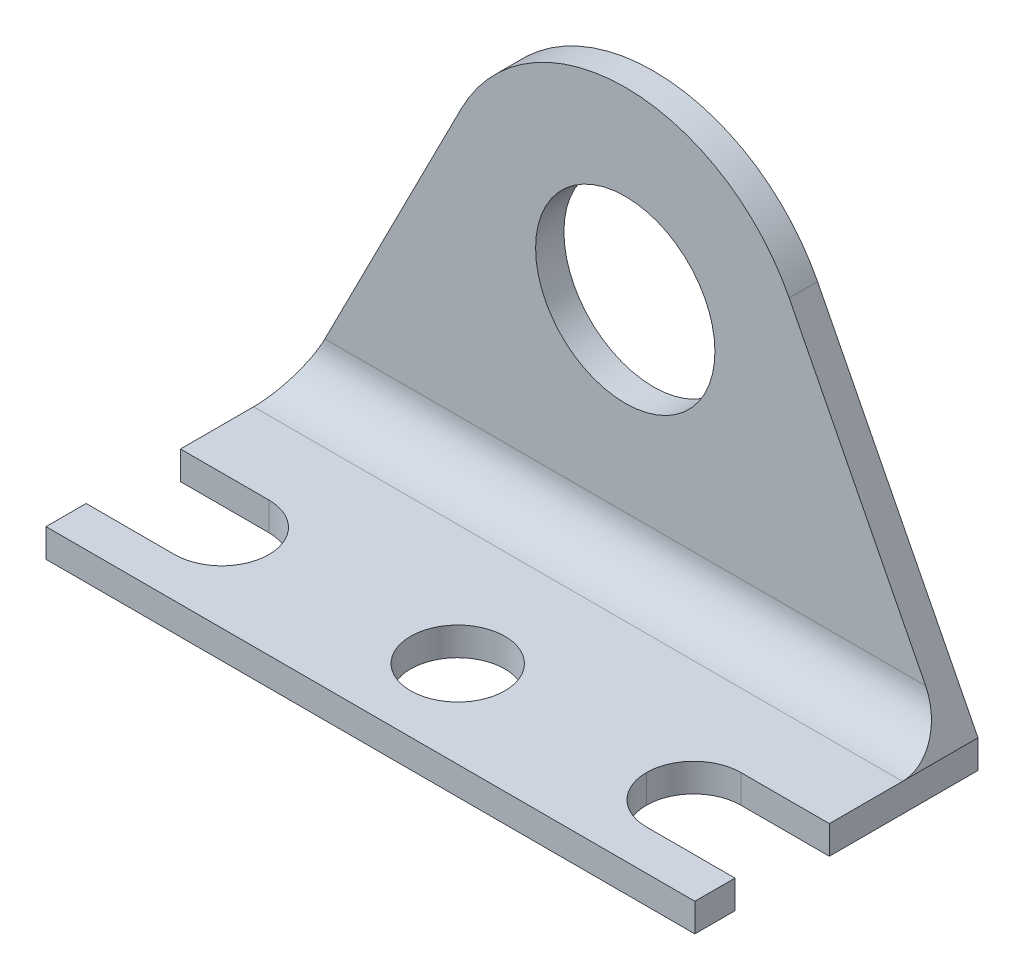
from build123d import *

# Parameters (mm, degrees)
SKETCH1_R               = 4.826
EXTRUDE1_DEPTH          = 1.524
SKETCH2_W               = 34.925
SKETCH2_H               = 1.524
EXTRUDE2_DEPTH          = 15.24
SKETCH3_R               = 2.54
CUT_EXTRUDE1_DEPTH      = 33.199509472
CUT_EXTRUDE2_DEPTH      = 33.199509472
CUT_EXTRUDE2_DEPTH_BACK = 33.199509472
FILLET1_R               = 2.54


with BuildPart() as part:
    # Sketch1 → Extrude1 (new body)
    with BuildSketch(Plane.XY):
        with BuildLine():
            Line((-17.4625, 0), (17.4625, 0))
            Line((17.4625, 0), (17.4625, 1.524))
            Line((17.4625, 1.524), (8.825639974, 18.468545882))
            ThreePointArc((8.825639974, 18.468545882), (5.175241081, 22.416639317), (0, 23.876))
            ThreePointArc((0, 23.876), (-5.175241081, 22.416639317), (-8.825639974, 18.468545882))
            Line((-8.825639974, 18.468545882), (-17.4625, 1.524))
            Line((-17.4625, 1.524), (-17.4625, 0))
        make_face()
        with Locations(Location((0, 13.97, 0), (0, 0, 180))):
            Circle(SKETCH1_R, mode=Mode.SUBTRACT)
    extrude(amount=EXTRUDE1_DEPTH)

    # Sketch2 → Extrude2 (add)
    with BuildSketch(Plane(origin=(0, 0, 0), x_dir=(-1, 0, 0), z_dir=(0, 0, -1))):
        with Locations((0, 0.762)):
            Rectangle(SKETCH2_W, SKETCH2_H)
    extrude(amount=-EXTRUDE2_DEPTH)

    # Sketch3 → Cut-Extrude1 (cut, through all)
    with BuildSketch(Plane(origin=(0, 1.524, 0), x_dir=(-1, 0, 0), z_dir=(0, 1, 0))):
        with Locations(Location((0, 10.541, 0), (0, 0, 90))):
            Circle(SKETCH3_R)
    extrude(amount=-CUT_EXTRUDE1_DEPTH, mode=Mode.SUBTRACT)

    # Sketch4 → Cut-Extrude2 (cut, two sides: drawn at the far end of the back side and taken through both)
    with BuildSketch(Plane(origin=(0, 1.524, 0), x_dir=(-1, 0, 0), z_dir=(0, 1, 0)).offset(-CUT_EXTRUDE2_DEPTH_BACK)):
        with BuildLine():
            Line((12.7, 8.001), (17.4625, 8.001))
            Line((17.4625, 8.001), (17.4625, 13.081))
            Line((17.4625, 13.081), (12.7, 13.081))
            ThreePointArc((12.7, 13.081), (10.903948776, 12.337051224), (10.16, 10.541))
            ThreePointArc((10.16, 10.541), (10.903948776, 8.744948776), (12.7, 8.001))
        make_face()
    cut_extrude2 = extrude(amount=CUT_EXTRUDE2_DEPTH + CUT_EXTRUDE2_DEPTH_BACK, mode=Mode.SUBTRACT)

    # Mirror1: Cut-Extrude2 across plane
    add(cut_extrude2.mirror(Plane(origin=(0, 0, 0), x_dir=(0, 0, 1), z_dir=(1, 0, 0))), mode=Mode.SUBTRACT)

    # Fillet1
    fillet1_edges = [part.edges().sort_by_distance(p)[0] for p in [
        (0, 1.524, 1.524),
    ]]
    fillet(fillet1_edges, radius=FILLET1_R)


solid = part.part
